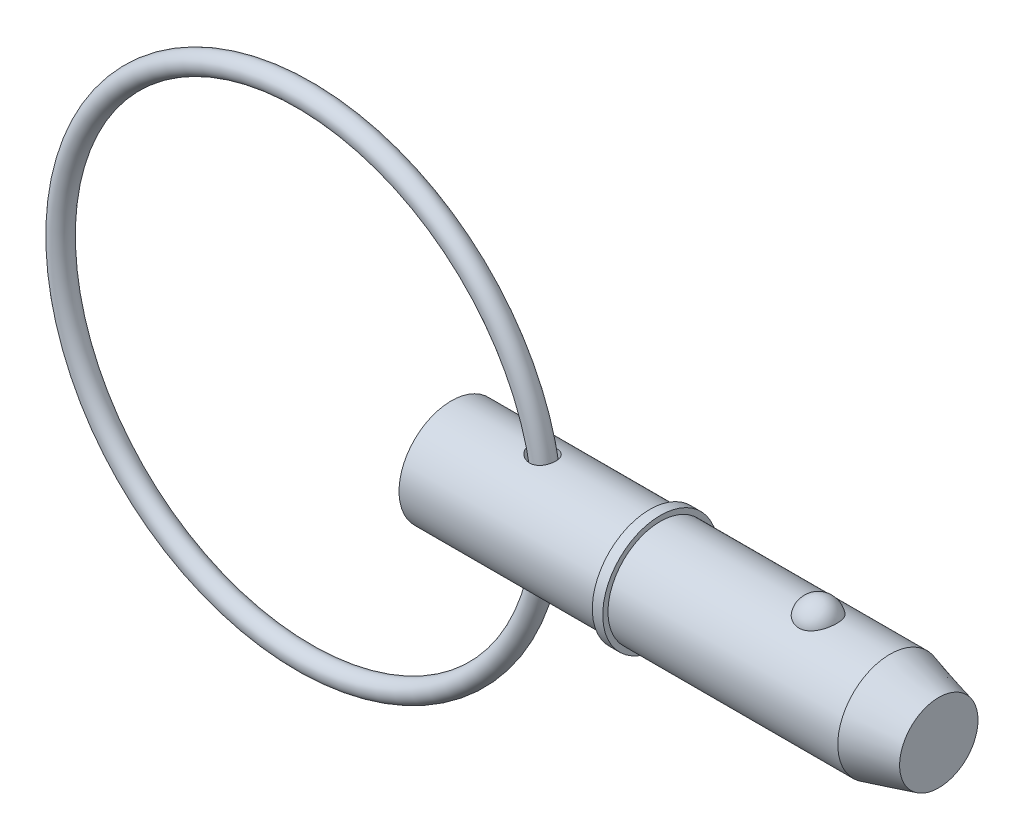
ISO-10303-21;
HEADER;
FILE_DESCRIPTION(('STEP AP214'),'2;1');
FILE_NAME('part.step','',(''),(''),'','','');
FILE_SCHEMA(('AUTOMOTIVE_DESIGN { 1 0 10303 214 1 1 1 1 }'));
ENDSEC;
DATA;
#1=APPLICATION_CONTEXT('core data for automotive mechanical design processes');
#2=APPLICATION_PROTOCOL_DEFINITION('international standard','automotive_design',2000,#1);
#3=PRODUCT_CONTEXT('',#1,'mechanical');
#4=PRODUCT('Part','Part','',(#3));
#5=PRODUCT_RELATED_PRODUCT_CATEGORY('part','',(#4));
#6=PRODUCT_DEFINITION_FORMATION('','',#4);
#7=PRODUCT_DEFINITION_CONTEXT('part definition',#1,'design');
#8=PRODUCT_DEFINITION('design','',#6,#7);
#9=PRODUCT_DEFINITION_SHAPE('','',#8);
#10=(LENGTH_UNIT() NAMED_UNIT(*) SI_UNIT(.MILLI.,.METRE.));
#11=(NAMED_UNIT(*) PLANE_ANGLE_UNIT() SI_UNIT($,.RADIAN.));
#12=(NAMED_UNIT(*) SI_UNIT($,.STERADIAN.) SOLID_ANGLE_UNIT());
#13=UNCERTAINTY_MEASURE_WITH_UNIT(LENGTH_MEASURE(1.E-05),#10,'distance_accuracy_value','');
#14=(GEOMETRIC_REPRESENTATION_CONTEXT(3) GLOBAL_UNCERTAINTY_ASSIGNED_CONTEXT((#13)) GLOBAL_UNIT_ASSIGNED_CONTEXT((#10,
#11,#12)) REPRESENTATION_CONTEXT('',''));
#15=CARTESIAN_POINT('',(0.,0.,0.));
#16=DIRECTION('',(0.,0.,1.));
#17=DIRECTION('',(1.,0.,0.));
#18=AXIS2_PLACEMENT_3D('',#15,#16,#17);
#19=CARTESIAN_POINT('',(-13.4013067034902,0.,0.));
#20=DIRECTION('',(0.,0.,1.));
#21=DIRECTION('',(1.,0.,0.));
#22=AXIS2_PLACEMENT_3D('',#19,#20,#21);
#23=TOROIDAL_SURFACE('',#22,22.225,0.952999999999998);
#24=CARTESIAN_POINT('',(9.77669329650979,0.,0.));
#25=VERTEX_POINT('',#24);
#26=VERTEX_LOOP('',#25);
#27=FACE_BOUND('',#26,.T.);
#28=ADVANCED_FACE('P0_F12',(#27),#23,.T.);
#29=CLOSED_SHELL('',(#28));
#30=MANIFOLD_SOLID_BREP('P0_B1',#29);
#31=CARTESIAN_POINT('',(0.,0.,0.));
#32=DIRECTION('',(1.,0.,0.));
#33=DIRECTION('',(0.,0.,-1.));
#34=AXIS2_PLACEMENT_3D('',#31,#32,#33);
#35=CYLINDRICAL_SURFACE('',#34,4.765);
#36=CARTESIAN_POINT('',(7.31773584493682,4.71580709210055,-0.682926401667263));
#37=CARTESIAN_POINT('',(7.3607471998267,4.70750812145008,-0.740230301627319));
#38=CARTESIAN_POINT('',(7.40883112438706,4.69869300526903,-0.79371122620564));
#39=CARTESIAN_POINT('',(7.51340999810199,4.68106981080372,-0.89180043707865));
#40=CARTESIAN_POINT('',(7.56991882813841,4.67226176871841,-0.936393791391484));
#41=CARTESIAN_POINT('',(7.689548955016,4.65568581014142,-1.01560363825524));
#42=CARTESIAN_POINT('',(7.75265928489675,4.64791621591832,-1.05023633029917));
#43=CARTESIAN_POINT('',(7.88387110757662,4.6343185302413,-1.10870278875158));
#44=CARTESIAN_POINT('',(7.95197058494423,4.62848966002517,-1.13254088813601));
#45=CARTESIAN_POINT('',(8.09209413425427,4.6194749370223,-1.16877415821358));
#46=CARTESIAN_POINT('',(8.16415141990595,4.6163169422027,-1.18104886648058));
#47=CARTESIAN_POINT('',(8.30937958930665,4.61324608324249,-1.19299123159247));
#48=CARTESIAN_POINT('',(8.38255011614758,4.61333220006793,-1.19266284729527));
#49=CARTESIAN_POINT('',(8.52374186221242,4.61674026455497,-1.17939593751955));
#50=CARTESIAN_POINT('',(8.59183022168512,4.61989017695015,-1.16712781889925));
#51=CARTESIAN_POINT('',(8.72470143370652,4.62884731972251,-1.13107903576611));
#52=CARTESIAN_POINT('',(8.78948513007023,4.63465386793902,-1.10730132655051));
#53=CARTESIAN_POINT('',(8.91088768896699,4.64792402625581,-1.05016249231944));
#54=CARTESIAN_POINT('',(8.96774302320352,4.65530108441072,-1.01728198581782));
#55=CARTESIAN_POINT('',(9.07499804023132,4.67102002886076,-0.942471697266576));
#56=CARTESIAN_POINT('',(9.12539777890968,4.6793619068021,-0.900541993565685));
#57=CARTESIAN_POINT('',(9.21836221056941,4.69607497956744,-0.808868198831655));
#58=CARTESIAN_POINT('',(9.26093651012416,4.70444612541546,-0.759133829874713));
#59=CARTESIAN_POINT('',(9.33728390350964,4.72032100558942,-0.653192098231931));
#60=CARTESIAN_POINT('',(9.3710564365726,4.72782468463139,-0.596984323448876));
#61=CARTESIAN_POINT('',(9.42940600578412,4.74126034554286,-0.478808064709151));
#62=CARTESIAN_POINT('',(9.45384681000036,4.74716869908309,-0.416769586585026));
#63=CARTESIAN_POINT('',(9.49226260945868,4.75663465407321,-0.289362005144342));
#64=CARTESIAN_POINT('',(9.50623742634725,4.76019221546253,-0.22399284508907));
#65=CARTESIAN_POINT('',(9.52342004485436,4.76458450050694,-0.0914886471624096));
#66=CARTESIAN_POINT('',(9.52658321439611,4.7654079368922,-0.0243474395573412));
#67=CARTESIAN_POINT('',(9.52194012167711,4.76421136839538,0.109528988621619));
#68=CARTESIAN_POINT('',(9.51413380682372,4.7621913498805,0.176264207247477));
#69=CARTESIAN_POINT('',(9.48775485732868,4.75552896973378,0.307367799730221));
#70=CARTESIAN_POINT('',(9.4691926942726,4.75088915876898,0.371738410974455));
#71=CARTESIAN_POINT('',(9.42175836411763,4.73949008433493,0.496364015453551));
#72=CARTESIAN_POINT('',(9.39288586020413,4.73273075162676,0.556618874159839));
#73=CARTESIAN_POINT('',(9.32549385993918,4.71782154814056,0.671371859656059));
#74=CARTESIAN_POINT('',(9.28696367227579,4.70967013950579,0.725863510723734));
#75=CARTESIAN_POINT('',(9.20123305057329,4.6928883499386,0.827453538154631));
#76=CARTESIAN_POINT('',(9.15403300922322,4.68425799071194,0.874552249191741));
#77=CARTESIAN_POINT('',(9.05250467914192,4.66754854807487,0.959736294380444));
#78=CARTESIAN_POINT('',(8.99822095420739,4.65946646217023,0.997874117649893));
#79=CARTESIAN_POINT('',(8.88381123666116,4.64472049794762,1.06440739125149));
#80=CARTESIAN_POINT('',(8.82368614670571,4.63805640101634,1.09280434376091));
#81=CARTESIAN_POINT('',(8.70022952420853,4.62698068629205,1.13878427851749));
#82=CARTESIAN_POINT('',(8.63695594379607,4.62253830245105,1.15651569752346));
#83=CARTESIAN_POINT('',(8.50825296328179,4.61622454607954,1.18146656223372));
#84=CARTESIAN_POINT('',(8.44282353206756,4.61435321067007,1.18868585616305));
#85=CARTESIAN_POINT('',(8.31119087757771,4.61332122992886,1.19268442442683));
#86=CARTESIAN_POINT('',(8.24498542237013,4.61417920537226,1.18939198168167));
#87=CARTESIAN_POINT('',(8.11397487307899,4.61847671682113,1.17259121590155));
#88=CARTESIAN_POINT('',(8.04917011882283,4.62191687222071,1.15908044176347));
#89=CARTESIAN_POINT('',(7.91946226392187,4.63117528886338,1.12153047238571));
#90=CARTESIAN_POINT('',(7.85470460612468,4.6371000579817,1.09701575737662));
#91=CARTESIAN_POINT('',(7.7300035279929,4.65063246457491,1.03814807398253));
#92=CARTESIAN_POINT('',(7.67006197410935,4.65824075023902,1.00379131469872));
#93=CARTESIAN_POINT('',(7.55352765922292,4.67473656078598,0.924015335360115));
#94=CARTESIAN_POINT('',(7.49726947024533,4.68366994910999,0.878115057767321));
#95=CARTESIAN_POINT('',(7.39344083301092,4.70144936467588,0.777311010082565));
#96=CARTESIAN_POINT('',(7.34587087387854,4.71029538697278,0.722406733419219));
#97=CARTESIAN_POINT('',(7.26188955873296,4.72669773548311,0.605773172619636));
#98=CARTESIAN_POINT('',(7.22531316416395,4.73427229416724,0.544165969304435));
#99=CARTESIAN_POINT('',(7.16406269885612,4.74732663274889,0.415095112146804));
#100=CARTESIAN_POINT('',(7.13937848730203,4.75280819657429,0.347636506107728));
#101=CARTESIAN_POINT('',(7.10494917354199,4.7605495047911,0.215359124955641));
#102=CARTESIAN_POINT('',(7.09405441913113,4.76305589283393,0.150853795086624));
#103=CARTESIAN_POINT('',(7.08387189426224,4.76539656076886,0.0208839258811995));
#104=CARTESIAN_POINT('',(7.0845805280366,4.76523166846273,-0.0445803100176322));
#105=CARTESIAN_POINT('',(7.09709111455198,4.76236014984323,-0.169693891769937));
#106=CARTESIAN_POINT('',(7.10810913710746,4.75983315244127,-0.229428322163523));
#107=CARTESIAN_POINT('',(7.13959099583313,4.75276726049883,-0.346187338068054));
#108=CARTESIAN_POINT('',(7.16004881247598,4.7482296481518,-0.403213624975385));
#109=CARTESIAN_POINT('',(7.20270325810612,4.73907067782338,-0.498040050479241));
#110=CARTESIAN_POINT('',(7.22286864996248,4.73481668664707,-0.536809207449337));
#111=CARTESIAN_POINT('',(7.26730952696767,4.72570777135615,-0.611832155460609));
#112=CARTESIAN_POINT('',(7.29158512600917,4.72085283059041,-0.64808587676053));
#113=CARTESIAN_POINT('',(7.31773584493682,4.71580709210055,-0.682926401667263));
#114=B_SPLINE_CURVE_WITH_KNOTS('',3,(#36,#37,#38,#39,#40,#41,#42,#43,#44,#45,#46,#47,#48,#49,
#50,#51,#52,#53,#54,#55,#56,#57,#58,#59,#60,#61,#62,#63,#64,#65,#66,#67,#68,#69,#70,#71,#72,#73,
#74,#75,#76,#77,#78,#79,#80,#81,#82,#83,#84,#85,#86,#87,#88,#89,#90,#91,#92,#93,#94,#95,#96,#97,
#98,#99,#100,#101,#102,#103,#104,#105,#106,#107,#108,#109,#110,#111,#112,#113),.UNSPECIFIED.,
.T.,.F.,(4,2,2,2,2,2,2,2,2,2,2,2,2,2,2,2,2,2,2,2,2,2,2,2,2,2,2,2,2,2,2,2,2,2,2,2,2,2,4),(0.,
0.216219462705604,0.432799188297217,0.649024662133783,0.865163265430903,1.08352938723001,
1.30182691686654,1.50853487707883,1.71518978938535,1.91252381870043,2.1098561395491,
2.30694457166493,2.50404555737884,2.70392296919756,2.90380378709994,3.10450875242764,
3.30521468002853,3.5057255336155,3.70624293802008,3.90698330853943,4.10771458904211,
4.30723900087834,4.50673262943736,4.70338139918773,4.90003300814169,5.09802914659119,
5.29607279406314,5.5036500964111,5.7113074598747,5.92972727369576,6.14815938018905,
6.36312650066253,6.57790998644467,6.77325899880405,6.96854747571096,7.15009726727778,
7.33153144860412,7.46298830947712,7.59444881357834),.UNSPECIFIED.);
#115=CARTESIAN_POINT('',(7.31773584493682,4.71580709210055,-0.682926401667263));
#116=VERTEX_POINT('',#115);
#117=EDGE_CURVE('P1_E42',#116,#116,#114,.T.);
#118=ORIENTED_EDGE('',*,*,#117,.T.);
#119=EDGE_LOOP('',(#118));
#120=FACE_BOUND('',#119,.T.);
#121=CARTESIAN_POINT('',(0.,0.,0.));
#122=DIRECTION('',(1.,0.,0.));
#123=DIRECTION('',(0.,0.,-1.));
#124=AXIS2_PLACEMENT_3D('',#121,#122,#123);
#125=CIRCLE('',#124,4.765);
#126=CARTESIAN_POINT('',(0.,0.,-4.765));
#127=VERTEX_POINT('',#126);
#128=EDGE_CURVE('P1_E9',#127,#127,#125,.T.);
#129=ORIENTED_EDGE('',*,*,#128,.T.);
#130=EDGE_LOOP('',(#129));
#131=FACE_BOUND('',#130,.T.);
#132=CARTESIAN_POINT('',(18.097,0.,0.));
#133=DIRECTION('',(1.,0.,0.));
#134=DIRECTION('',(0.,0.,-1.));
#135=AXIS2_PLACEMENT_3D('',#132,#133,#134);
#136=CIRCLE('',#135,4.765);
#137=CARTESIAN_POINT('',(18.097,0.,-4.765));
#138=VERTEX_POINT('',#137);
#139=EDGE_CURVE('P1_E25',#138,#138,#136,.T.);
#140=ORIENTED_EDGE('',*,*,#139,.F.);
#141=EDGE_LOOP('',(#140));
#142=FACE_BOUND('',#141,.T.);
#143=CARTESIAN_POINT('',(7.31773584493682,-4.71580709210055,-0.682926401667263));
#144=CARTESIAN_POINT('',(7.27956054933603,-4.72317282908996,-0.63206220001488));
#145=CARTESIAN_POINT('',(7.24535712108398,-4.7301361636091,-0.578155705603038));
#146=CARTESIAN_POINT('',(7.18611785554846,-4.74256090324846,-0.465352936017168));
#147=CARTESIAN_POINT('',(7.16107836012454,-4.74802290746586,-0.406458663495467));
#148=CARTESIAN_POINT('',(7.12119149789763,-4.75686558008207,-0.284913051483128));
#149=CARTESIAN_POINT('',(7.1063796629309,-4.76023898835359,-0.222249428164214));
#150=CARTESIAN_POINT('',(7.08786546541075,-4.76447177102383,-0.0952170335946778));
#151=CARTESIAN_POINT('',(7.08416018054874,-4.76533180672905,-0.0308487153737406));
#152=CARTESIAN_POINT('',(7.08795686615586,-4.76445764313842,0.0942755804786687));
#153=CARTESIAN_POINT('',(7.09490366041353,-4.762851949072,0.155050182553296));
#154=CARTESIAN_POINT('',(7.11863973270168,-4.75746086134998,0.2745356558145));
#155=CARTESIAN_POINT('',(7.13542953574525,-4.75367535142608,0.333246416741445));
#156=CARTESIAN_POINT('',(7.17817193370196,-4.74430545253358,0.447305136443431));
#157=CARTESIAN_POINT('',(7.20415836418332,-4.73871442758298,0.502639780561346));
#158=CARTESIAN_POINT('',(7.26428068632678,-4.72628508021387,0.608523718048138));
#159=CARTESIAN_POINT('',(7.29841897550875,-4.71944639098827,0.659071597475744));
#160=CARTESIAN_POINT('',(7.37680984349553,-4.70456239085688,0.758311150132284));
#161=CARTESIAN_POINT('',(7.42165519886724,-4.69646426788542,0.806526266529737));
#162=CARTESIAN_POINT('',(7.51828933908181,-4.68032890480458,0.895428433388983));
#163=CARTESIAN_POINT('',(7.57008134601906,-4.67229169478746,0.936111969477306));
#164=CARTESIAN_POINT('',(7.68397204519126,-4.65640659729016,1.01229731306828));
#165=CARTESIAN_POINT('',(7.74657226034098,-4.64863251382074,1.04706751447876));
#166=CARTESIAN_POINT('',(7.87680110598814,-4.6349740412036,1.10596507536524));
#167=CARTESIAN_POINT('',(7.94443054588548,-4.62908995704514,1.13009071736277));
#168=CARTESIAN_POINT('',(8.08402017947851,-4.61989019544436,1.16713943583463));
#169=CARTESIAN_POINT('',(8.15603143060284,-4.61661596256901,1.17988211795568));
#170=CARTESIAN_POINT('',(8.30124697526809,-4.61330446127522,1.1927680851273));
#171=CARTESIAN_POINT('',(8.37445077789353,-4.61326589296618,1.19291642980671));
#172=CARTESIAN_POINT('',(8.51584800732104,-4.61644036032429,1.18056687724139));
#173=CARTESIAN_POINT('',(8.58410302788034,-4.61948317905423,1.16873099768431));
#174=CARTESIAN_POINT('',(8.71738052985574,-4.6282520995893,1.13350536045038));
#175=CARTESIAN_POINT('',(8.78240382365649,-4.63397752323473,1.11011852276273));
#176=CARTESIAN_POINT('',(8.90428519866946,-4.64711877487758,1.05371003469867));
#177=CARTESIAN_POINT('',(8.96138096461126,-4.6544450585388,1.02117932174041));
#178=CARTESIAN_POINT('',(9.06916653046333,-4.6700970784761,0.947021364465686));
#179=CARTESIAN_POINT('',(9.11985639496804,-4.67842280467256,0.905394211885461));
#180=CARTESIAN_POINT('',(9.2134071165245,-4.69513303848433,0.814300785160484));
#181=CARTESIAN_POINT('',(9.25628268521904,-4.70351740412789,0.764849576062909));
#182=CARTESIAN_POINT('',(9.33327173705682,-4.71945185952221,0.659422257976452));
#183=CARTESIAN_POINT('',(9.3673846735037,-4.72700189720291,0.603445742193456));
#184=CARTESIAN_POINT('',(9.42645214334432,-4.74055953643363,0.485673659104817));
#185=CARTESIAN_POINT('',(9.45127042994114,-4.74654383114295,0.423807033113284));
#186=CARTESIAN_POINT('',(9.49046298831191,-4.756182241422,0.296676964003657));
#187=CARTESIAN_POINT('',(9.50483706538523,-4.75983631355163,0.231413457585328));
#188=CARTESIAN_POINT('',(9.52283408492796,-4.76443282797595,0.0990368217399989));
#189=CARTESIAN_POINT('',(9.52641016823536,-4.76536345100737,0.0319169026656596));
#190=CARTESIAN_POINT('',(9.52259067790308,-4.76437893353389,-0.101988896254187));
#191=CARTESIAN_POINT('',(9.5151950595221,-4.76246378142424,-0.168774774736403));
#192=CARTESIAN_POINT('',(9.48962516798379,-4.75599746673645,-0.300048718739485));
#193=CARTESIAN_POINT('',(9.4714615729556,-4.75144891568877,-0.364538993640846));
#194=CARTESIAN_POINT('',(9.42480303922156,-4.74020887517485,-0.489470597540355));
#195=CARTESIAN_POINT('',(9.396307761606,-4.73351731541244,-0.549911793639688));
#196=CARTESIAN_POINT('',(9.32963953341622,-4.71871240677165,-0.665099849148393));
#197=CARTESIAN_POINT('',(9.29145577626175,-4.71059747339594,-0.719840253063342));
#198=CARTESIAN_POINT('',(9.20637695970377,-4.69385254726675,-0.82198328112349));
#199=CARTESIAN_POINT('',(9.15948227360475,-4.68522257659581,-0.869386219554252));
#200=CARTESIAN_POINT('',(9.05849937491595,-4.66847516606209,-0.955233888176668));
#201=CARTESIAN_POINT('',(9.00445430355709,-4.6603550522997,-0.993728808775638));
#202=CARTESIAN_POINT('',(8.8904576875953,-4.64550122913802,-1.06100691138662));
#203=CARTESIAN_POINT('',(8.83050704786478,-4.63876730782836,-1.08979157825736));
#204=CARTESIAN_POINT('',(8.70732873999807,-4.6275305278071,-1.13655620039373));
#205=CARTESIAN_POINT('',(8.64416019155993,-4.62299714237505,-1.15468477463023));
#206=CARTESIAN_POINT('',(8.51559711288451,-4.61649071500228,-1.18043067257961));
#207=CARTESIAN_POINT('',(8.4502025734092,-4.61451768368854,-1.18804795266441));
#208=CARTESIAN_POINT('',(8.31862013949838,-4.61328355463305,-1.19283094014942));
#209=CARTESIAN_POINT('',(8.25242983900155,-4.61403911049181,-1.18993246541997));
#210=CARTESIAN_POINT('',(8.12138461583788,-4.61814057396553,-1.17391149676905));
#211=CARTESIAN_POINT('',(8.0565300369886,-4.62148714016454,-1.16078640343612));
#212=CARTESIAN_POINT('',(7.92669960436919,-4.63056912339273,-1.12402333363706));
#213=CARTESIAN_POINT('',(7.86186447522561,-4.63641051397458,-1.09991536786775));
#214=CARTESIAN_POINT('',(7.73694230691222,-4.64980121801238,-1.04185298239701));
#215=CARTESIAN_POINT('',(7.6768568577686,-4.65735110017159,-1.0078952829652));
#216=CARTESIAN_POINT('',(7.56207884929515,-4.67346080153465,-0.930364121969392));
#217=CARTESIAN_POINT('',(7.5074784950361,-4.68203382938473,-0.886656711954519));
#218=CARTESIAN_POINT('',(7.40624045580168,-4.69916824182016,-0.79082583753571));
#219=CARTESIAN_POINT('',(7.35959988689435,-4.7077296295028,-0.738705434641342));
#220=CARTESIAN_POINT('',(7.31773584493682,-4.71580709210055,-0.682926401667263));
#221=B_SPLINE_CURVE_WITH_KNOTS('',3,(#143,#144,#145,#146,#147,#148,#149,#150,#151,#152,#153,
#154,#155,#156,#157,#158,#159,#160,#161,#162,#163,#164,#165,#166,#167,#168,#169,#170,#171,#172,
#173,#174,#175,#176,#177,#178,#179,#180,#181,#182,#183,#184,#185,#186,#187,#188,#189,#190,#191,
#192,#193,#194,#195,#196,#197,#198,#199,#200,#201,#202,#203,#204,#205,#206,#207,#208,#209,#210,
#211,#212,#213,#214,#215,#216,#217,#218,#219,#220),.UNSPECIFIED.,.T.,.F.,(4,2,2,2,2,2,2,2,2,2,2,
2,2,2,2,2,2,2,2,2,2,2,2,2,2,2,2,2,2,2,2,2,2,2,2,2,2,2,4),(0.,0.191851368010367,0.38362606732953,
0.576063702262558,0.768450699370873,0.951145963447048,1.13385097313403,1.31723528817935,
1.50067360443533,1.69887079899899,1.8971602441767,2.11225870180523,2.32739185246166,
2.54587681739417,2.76427400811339,2.97123130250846,3.17813630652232,3.37555441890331,
3.57297054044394,3.77001106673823,3.96706388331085,4.16690159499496,4.36674303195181,
4.56745046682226,4.76815872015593,4.96866827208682,5.16918440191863,5.36992517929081,
5.5706573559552,5.77022940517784,5.96977092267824,6.16645904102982,6.36314797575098,
6.56103940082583,6.75898114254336,6.96633026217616,7.17374850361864,7.384214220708,
7.59460352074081),.UNSPECIFIED.);
#222=CARTESIAN_POINT('',(7.31773584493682,-4.71580709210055,-0.682926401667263));
#223=VERTEX_POINT('',#222);
#224=EDGE_CURVE('P1_E17',#223,#223,#221,.T.);
#225=ORIENTED_EDGE('',*,*,#224,.T.);
#226=EDGE_LOOP('',(#225));
#227=FACE_BOUND('',#226,.T.);
#228=ADVANCED_FACE('P1_F13',(#120,#131,#142,#227),#35,.T.);
#229=CARTESIAN_POINT('',(0.,0.,0.));
#230=DIRECTION('',(1.,0.,0.));
#231=DIRECTION('',(0.,0.,-1.));
#232=AXIS2_PLACEMENT_3D('',#229,#230,#231);
#233=CYLINDRICAL_SURFACE('',#232,4.765);
#234=CARTESIAN_POINT('',(40.0041944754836,0.,0.));
#235=DIRECTION('',(1.,0.,0.));
#236=DIRECTION('',(0.,0.,-1.));
#237=AXIS2_PLACEMENT_3D('',#234,#235,#236);
#238=CIRCLE('',#237,4.765);
#239=CARTESIAN_POINT('',(40.0041944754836,0.,-4.765));
#240=VERTEX_POINT('',#239);
#241=EDGE_CURVE('P1_E99',#240,#240,#238,.T.);
#242=ORIENTED_EDGE('',*,*,#241,.F.);
#243=EDGE_LOOP('',(#242));
#244=FACE_BOUND('',#243,.T.);
#245=CARTESIAN_POINT('',(19.05,0.,0.));
#246=DIRECTION('',(1.,0.,0.));
#247=DIRECTION('',(0.,0.,-1.));
#248=AXIS2_PLACEMENT_3D('',#245,#246,#247);
#249=CIRCLE('',#248,4.765);
#250=CARTESIAN_POINT('',(19.05,0.,-4.765));
#251=VERTEX_POINT('',#250);
#252=EDGE_CURVE('P1_E96',#251,#251,#249,.T.);
#253=ORIENTED_EDGE('',*,*,#252,.T.);
#254=EDGE_LOOP('',(#253));
#255=FACE_BOUND('',#254,.T.);
#256=CARTESIAN_POINT('',(33.451020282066,4.42764777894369,1.76101111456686));
#257=CARTESIAN_POINT('',(33.3597212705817,4.42764470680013,1.76101422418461));
#258=CARTESIAN_POINT('',(33.2684468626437,4.4305909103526,1.75366340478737));
#259=CARTESIAN_POINT('',(33.0886154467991,4.44201846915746,1.72451180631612));
#260=CARTESIAN_POINT('',(33.0000577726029,4.45049845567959,1.702714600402));
#261=CARTESIAN_POINT('',(32.8282570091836,4.47200516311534,1.64539370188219));
#262=CARTESIAN_POINT('',(32.7450064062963,4.48502527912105,1.60988994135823));
#263=CARTESIAN_POINT('',(32.5857633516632,4.51419542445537,1.52617873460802));
#264=CARTESIAN_POINT('',(32.5097723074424,4.53034605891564,1.47796883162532));
#265=CARTESIAN_POINT('',(32.3647445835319,4.5645931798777,1.36860494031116));
#266=CARTESIAN_POINT('',(32.2959645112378,4.58273170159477,1.30712420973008));
#267=CARTESIAN_POINT('',(32.1693423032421,4.61870302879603,1.1737020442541));
#268=CARTESIAN_POINT('',(32.1115021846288,4.63653577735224,1.1017586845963));
#269=CARTESIAN_POINT('',(32.0055709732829,4.67090140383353,0.945806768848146));
#270=CARTESIAN_POINT('',(31.9580305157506,4.68734068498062,0.861402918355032));
#271=CARTESIAN_POINT('',(31.8770817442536,4.71628466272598,0.685442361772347));
#272=CARTESIAN_POINT('',(31.8436747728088,4.72878898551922,0.593884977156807));
#273=CARTESIAN_POINT('',(31.791287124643,4.74874061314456,0.404781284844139));
#274=CARTESIAN_POINT('',(31.7725178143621,4.75611366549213,0.307168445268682));
#275=CARTESIAN_POINT('',(31.7505846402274,4.76475393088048,0.109940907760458));
#276=CARTESIAN_POINT('',(31.7474205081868,4.76602124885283,0.0103262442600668));
#277=CARTESIAN_POINT('',(31.7567405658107,4.76232928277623,-0.187629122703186));
#278=CARTESIAN_POINT('',(31.7691588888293,4.7573962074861,-0.285973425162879));
#279=CARTESIAN_POINT('',(31.8092804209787,4.74184975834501,-0.479027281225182));
#280=CARTESIAN_POINT('',(31.8369839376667,4.7312362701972,-0.573736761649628));
#281=CARTESIAN_POINT('',(31.9071581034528,4.70540026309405,-0.756973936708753));
#282=CARTESIAN_POINT('',(31.9496460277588,4.69017235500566,-0.845494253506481));
#283=CARTESIAN_POINT('',(32.048520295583,4.65669867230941,-1.01378033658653));
#284=CARTESIAN_POINT('',(32.1049076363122,4.63845268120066,-1.09354547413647));
#285=CARTESIAN_POINT('',(32.230552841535,4.60085438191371,-1.24228523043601));
#286=CARTESIAN_POINT('',(32.2998439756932,4.58149930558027,-1.31123108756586));
#287=CARTESIAN_POINT('',(32.4496066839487,4.54391653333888,-1.43607409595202));
#288=CARTESIAN_POINT('',(32.5300771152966,4.52568872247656,-1.49197257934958));
#289=CARTESIAN_POINT('',(32.6981500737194,4.49293007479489,-1.58786764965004));
#290=CARTESIAN_POINT('',(32.7855445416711,4.47832346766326,-1.62820219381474));
#291=CARTESIAN_POINT('',(32.966553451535,4.45406011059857,-1.69345757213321));
#292=CARTESIAN_POINT('',(33.0601655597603,4.44440151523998,-1.71838415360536));
#293=CARTESIAN_POINT('',(33.2458939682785,4.43159888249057,-1.7511284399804));
#294=CARTESIAN_POINT('',(33.337849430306,4.42815213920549,-1.75974223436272));
#295=CARTESIAN_POINT('',(33.5219658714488,4.42724735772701,-1.76201865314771));
#296=CARTESIAN_POINT('',(33.6141268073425,4.42978816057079,-1.75568417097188));
#297=CARTESIAN_POINT('',(33.7931292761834,4.4403864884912,-1.72869560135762));
#298=CARTESIAN_POINT('',(33.8800474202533,4.44827555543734,-1.7084785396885));
#299=CARTESIAN_POINT('',(34.0491314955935,4.46852246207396,-1.65479562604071));
#300=CARTESIAN_POINT('',(34.1312970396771,4.4808806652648,-1.62132869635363));
#301=CARTESIAN_POINT('',(34.2905916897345,4.50907357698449,-1.54120560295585));
#302=CARTESIAN_POINT('',(34.3675700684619,4.52497884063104,-1.49427526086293));
#303=CARTESIAN_POINT('',(34.5127080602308,4.55845148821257,-1.38881222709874));
#304=CARTESIAN_POINT('',(34.5808656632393,4.57601924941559,-1.33027689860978));
#305=CARTESIAN_POINT('',(34.7100990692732,4.61196537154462,-1.19991049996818));
#306=CARTESIAN_POINT('',(34.7706562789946,4.63034074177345,-1.12756415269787));
#307=CARTESIAN_POINT('',(34.8792797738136,4.66513959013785,-0.97361299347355));
#308=CARTESIAN_POINT('',(34.9273438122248,4.68156271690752,-0.892006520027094));
#309=CARTESIAN_POINT('',(35.011383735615,4.71130224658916,-0.71889227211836));
#310=CARTESIAN_POINT('',(35.0469185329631,4.724501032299,-0.627149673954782));
#311=CARTESIAN_POINT('',(35.1029522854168,4.74571823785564,-0.438611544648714));
#312=CARTESIAN_POINT('',(35.123450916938,4.75373654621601,-0.341815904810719));
#313=CARTESIAN_POINT('',(35.1490338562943,4.76378905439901,-0.145633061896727));
#314=CARTESIAN_POINT('',(35.154076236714,4.76580697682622,-0.0462395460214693));
#315=CARTESIAN_POINT('',(35.1485239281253,4.7636057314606,0.152038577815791));
#316=CARTESIAN_POINT('',(35.1379294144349,4.75938663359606,0.250923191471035));
#317=CARTESIAN_POINT('',(35.1013875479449,4.74516937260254,0.445004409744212));
#318=CARTESIAN_POINT('',(35.0754964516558,4.73519238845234,0.540213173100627));
#319=CARTESIAN_POINT('',(35.0089273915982,4.71049394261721,0.724662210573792));
#320=CARTESIAN_POINT('',(34.9682485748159,4.69577220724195,0.813902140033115));
#321=CARTESIAN_POINT('',(34.8727177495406,4.66303767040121,0.984313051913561));
#322=CARTESIAN_POINT('',(34.8178042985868,4.64501070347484,1.06544688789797));
#323=CARTESIAN_POINT('',(34.6950496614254,4.60764678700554,1.21692673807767));
#324=CARTESIAN_POINT('',(34.6272086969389,4.58830985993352,1.28727293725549));
#325=CARTESIAN_POINT('',(34.4805480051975,4.55060370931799,1.41479271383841));
#326=CARTESIAN_POINT('',(34.4017918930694,4.53222967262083,1.4720378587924));
#327=CARTESIAN_POINT('',(34.2349890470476,4.49849576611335,1.57212016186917));
#328=CARTESIAN_POINT('',(34.1469417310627,4.48313608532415,1.6149564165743));
#329=CARTESIAN_POINT('',(33.9597918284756,4.45676184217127,1.68642657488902));
#330=CARTESIAN_POINT('',(33.8603653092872,4.44598302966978,1.71430590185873));
#331=CARTESIAN_POINT('',(33.6576210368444,4.43142918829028,1.75159258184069));
#332=CARTESIAN_POINT('',(33.5543049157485,4.42765125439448,1.76100759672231));
#333=CARTESIAN_POINT('',(33.451020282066,4.42764777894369,1.76101111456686));
#334=B_SPLINE_CURVE_WITH_KNOTS('',3,(#256,#257,#258,#259,#260,#261,#262,#263,#264,#265,#266,
#267,#268,#269,#270,#271,#272,#273,#274,#275,#276,#277,#278,#279,#280,#281,#282,#283,#284,#285,
#286,#287,#288,#289,#290,#291,#292,#293,#294,#295,#296,#297,#298,#299,#300,#301,#302,#303,#304,
#305,#306,#307,#308,#309,#310,#311,#312,#313,#314,#315,#316,#317,#318,#319,#320,#321,#322,#323,
#324,#325,#326,#327,#328,#329,#330,#331,#332,#333),.UNSPECIFIED.,.T.,.F.,(4,2,2,2,2,2,2,2,2,2,2,
2,2,2,2,2,2,2,2,2,2,2,2,2,2,2,2,2,2,2,2,2,2,2,2,2,2,2,4),(0.,0.273517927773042,
0.546968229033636,0.820022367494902,1.09312934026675,1.37393946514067,1.65480131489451,
1.94820420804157,2.24163496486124,2.53922817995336,2.83681628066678,3.13315071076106,
3.42949110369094,3.72617893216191,4.02288805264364,4.3203730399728,4.61782764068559,
4.90840095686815,5.19886582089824,5.47474855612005,5.75057789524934,6.01809977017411,
6.28564340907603,6.55907787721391,6.83257454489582,7.1196298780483,7.40673679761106,
7.70312663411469,7.99952284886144,8.29672237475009,8.59391856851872,8.890028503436,
9.18615552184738,9.48358266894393,9.78100471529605,10.0767610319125,10.3725358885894,
10.6820893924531,10.9915144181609),.UNSPECIFIED.);
#335=CARTESIAN_POINT('',(33.451020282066,4.42764777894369,1.76101111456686));
#336=VERTEX_POINT('',#335);
#337=EDGE_CURVE('P1_E34',#336,#336,#334,.T.);
#338=ORIENTED_EDGE('',*,*,#337,.T.);
#339=EDGE_LOOP('',(#338));
#340=FACE_BOUND('',#339,.T.);
#341=ADVANCED_FACE('P1_F46',(#244,#255,#340),#233,.T.);
#342=CARTESIAN_POINT('',(0.,0.,0.));
#343=DIRECTION('',(-1.,0.,0.));
#344=DIRECTION('',(0.,0.,1.));
#345=AXIS2_PLACEMENT_3D('',#342,#343,#344);
#346=PLANE('',#345);
#347=ORIENTED_EDGE('',*,*,#128,.F.);
#348=EDGE_LOOP('',(#347));
#349=FACE_BOUND('',#348,.T.);
#350=ADVANCED_FACE('P1_F15',(#349),#346,.T.);
#351=CARTESIAN_POINT('',(18.097,4.765,0.));
#352=DIRECTION('',(-1.,0.,0.));
#353=DIRECTION('',(0.,0.,1.));
#354=AXIS2_PLACEMENT_3D('',#351,#352,#353);
#355=PLANE('',#354);
#356=ORIENTED_EDGE('',*,*,#139,.T.);
#357=EDGE_LOOP('',(#356));
#358=FACE_BOUND('',#357,.T.);
#359=CARTESIAN_POINT('',(18.097,0.,0.));
#360=DIRECTION('',(1.,0.,0.));
#361=DIRECTION('',(0.,0.,-1.));
#362=AXIS2_PLACEMENT_3D('',#359,#360,#361);
#363=CIRCLE('',#362,5.2415);
#364=CARTESIAN_POINT('',(18.097,0.,-5.2415));
#365=VERTEX_POINT('',#364);
#366=EDGE_CURVE('P1_E30',#365,#365,#363,.T.);
#367=ORIENTED_EDGE('',*,*,#366,.F.);
#368=EDGE_LOOP('',(#367));
#369=FACE_BOUND('',#368,.T.);
#370=ADVANCED_FACE('P1_F81',(#358,#369),#355,.T.);
#371=CARTESIAN_POINT('',(0.,0.,0.));
#372=DIRECTION('',(1.,0.,0.));
#373=DIRECTION('',(0.,0.,-1.));
#374=AXIS2_PLACEMENT_3D('',#371,#372,#373);
#375=CYLINDRICAL_SURFACE('',#374,5.2415);
#376=ORIENTED_EDGE('',*,*,#366,.T.);
#377=EDGE_LOOP('',(#376));
#378=FACE_BOUND('',#377,.T.);
#379=CARTESIAN_POINT('',(19.05,0.,0.));
#380=DIRECTION('',(1.,0.,0.));
#381=DIRECTION('',(0.,0.,-1.));
#382=AXIS2_PLACEMENT_3D('',#379,#380,#381);
#383=CIRCLE('',#382,5.2415);
#384=CARTESIAN_POINT('',(19.05,0.,-5.2415));
#385=VERTEX_POINT('',#384);
#386=EDGE_CURVE('P1_E95',#385,#385,#383,.T.);
#387=ORIENTED_EDGE('',*,*,#386,.F.);
#388=EDGE_LOOP('',(#387));
#389=FACE_BOUND('',#388,.T.);
#390=ADVANCED_FACE('P1_F68',(#378,#389),#375,.T.);
#391=CARTESIAN_POINT('',(19.05,5.2415,0.));
#392=DIRECTION('',(1.,0.,0.));
#393=DIRECTION('',(0.,0.,-1.));
#394=AXIS2_PLACEMENT_3D('',#391,#392,#393);
#395=PLANE('',#394);
#396=ORIENTED_EDGE('',*,*,#386,.T.);
#397=EDGE_LOOP('',(#396));
#398=FACE_BOUND('',#397,.T.);
#399=ORIENTED_EDGE('',*,*,#252,.F.);
#400=EDGE_LOOP('',(#399));
#401=FACE_BOUND('',#400,.T.);
#402=ADVANCED_FACE('P1_F62',(#398,#401),#395,.T.);
#403=CARTESIAN_POINT('',(44.45,0.,0.));
#404=DIRECTION('',(-1.,0.,0.));
#405=DIRECTION('',(0.,0.,1.));
#406=AXIS2_PLACEMENT_3D('',#403,#404,#405);
#407=CONICAL_SURFACE('',#406,3.57375000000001,0.26179938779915);
#408=ORIENTED_EDGE('',*,*,#241,.T.);
#409=EDGE_LOOP('',(#408));
#410=FACE_BOUND('',#409,.T.);
#411=CARTESIAN_POINT('',(44.45,0.,0.));
#412=DIRECTION('',(1.,0.,0.));
#413=DIRECTION('',(0.,0.,-1.));
#414=AXIS2_PLACEMENT_3D('',#411,#412,#413);
#415=CIRCLE('',#414,3.57375000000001);
#416=CARTESIAN_POINT('',(44.45,0.,-3.57375000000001));
#417=VERTEX_POINT('',#416);
#418=EDGE_CURVE('P1_E41',#417,#417,#415,.T.);
#419=ORIENTED_EDGE('',*,*,#418,.F.);
#420=EDGE_LOOP('',(#419));
#421=FACE_BOUND('',#420,.T.);
#422=ADVANCED_FACE('P1_F59',(#410,#421),#407,.T.);
#423=CARTESIAN_POINT('',(44.45,3.57375000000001,0.));
#424=DIRECTION('',(1.,0.,0.));
#425=DIRECTION('',(0.,0.,-1.));
#426=AXIS2_PLACEMENT_3D('',#423,#424,#425);
#427=PLANE('',#426);
#428=ORIENTED_EDGE('',*,*,#418,.T.);
#429=EDGE_LOOP('',(#428));
#430=FACE_BOUND('',#429,.T.);
#431=ADVANCED_FACE('P1_F55',(#430),#427,.T.);
#432=CARTESIAN_POINT('',(33.451020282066,4.2885,0.));
#433=DIRECTION('',(-1.,0.,0.));
#434=DIRECTION('',(0.,1.,0.));
#435=AXIS2_PLACEMENT_3D('',#432,#433,#434);
#436=SPHERICAL_SURFACE('',#435,1.76649999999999);
#437=ORIENTED_EDGE('',*,*,#337,.F.);
#438=EDGE_LOOP('',(#437));
#439=FACE_BOUND('',#438,.T.);
#440=ADVANCED_FACE('P1_F50',(#439),#436,.T.);
#441=CARTESIAN_POINT('',(-13.4013067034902,0.,0.));
#442=DIRECTION('',(0.,0.,1.));
#443=DIRECTION('',(1.,0.,0.));
#444=AXIS2_PLACEMENT_3D('',#441,#442,#443);
#445=TOROIDAL_SURFACE('',#444,22.225,1.19125);
#446=ORIENTED_EDGE('',*,*,#224,.F.);
#447=EDGE_LOOP('',(#446));
#448=FACE_BOUND('',#447,.T.);
#449=ORIENTED_EDGE('',*,*,#117,.F.);
#450=EDGE_LOOP('',(#449));
#451=FACE_BOUND('',#450,.T.);
#452=ADVANCED_FACE('P1_F54',(#448,#451),#445,.F.);
#453=CLOSED_SHELL('',(#228,#341,#350,#370,#390,#402,#422,#431,#440,#452));
#454=MANIFOLD_SOLID_BREP('P1_B1',#453);
#455=ADVANCED_BREP_SHAPE_REPRESENTATION('',(#18,#30,#454),#14);
#456=SHAPE_DEFINITION_REPRESENTATION(#9,#455);
ENDSEC;
END-ISO-10303-21;
